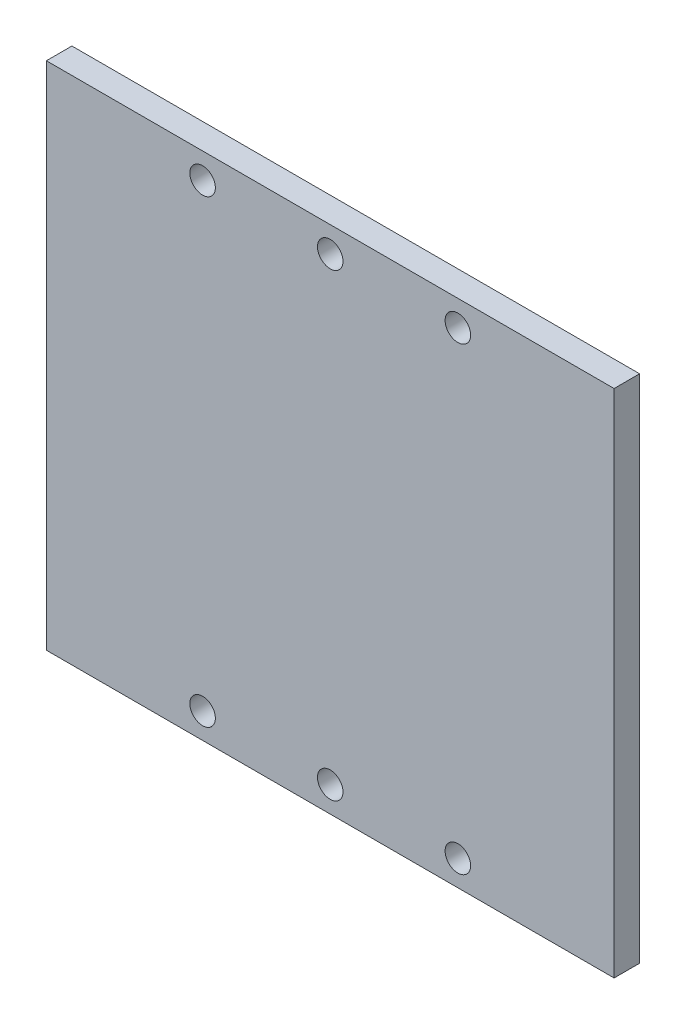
from build123d import *

# Parameters (mm, degrees)
CROQUIS1_W              = 44.48
CROQUIS1_H              = 40
CROQUIS1_R              = 1
SALIENTE_EXTRUIR2_DEPTH = 2


with BuildPart() as part:
    # Croquis1 → Saliente-Extruir2 (new body)
    with BuildSketch(Plane.XY):
        with Locations((-8.27, -15)):
            Rectangle(CROQUIS1_W, CROQUIS1_H)
        with Locations((-8.27, -33)):
            Circle(CROQUIS1_R, mode=Mode.SUBTRACT)
        with Locations((1.73, -33)):
            Circle(CROQUIS1_R, mode=Mode.SUBTRACT)
        with Locations((-18.27, -33)):
            Circle(CROQUIS1_R, mode=Mode.SUBTRACT)
        with Locations(Location((1.73, 3, 0), (0, 0, 180))):
            Circle(CROQUIS1_R, mode=Mode.SUBTRACT)
        with Locations(Location((-8.27, 3, 0), (0, 0, 180))):
            Circle(CROQUIS1_R, mode=Mode.SUBTRACT)
        with Locations(Location((-18.27, 3, 0), (0, 0, 180))):
            Circle(CROQUIS1_R, mode=Mode.SUBTRACT)
    extrude(amount=SALIENTE_EXTRUIR2_DEPTH)


solid = part.part
